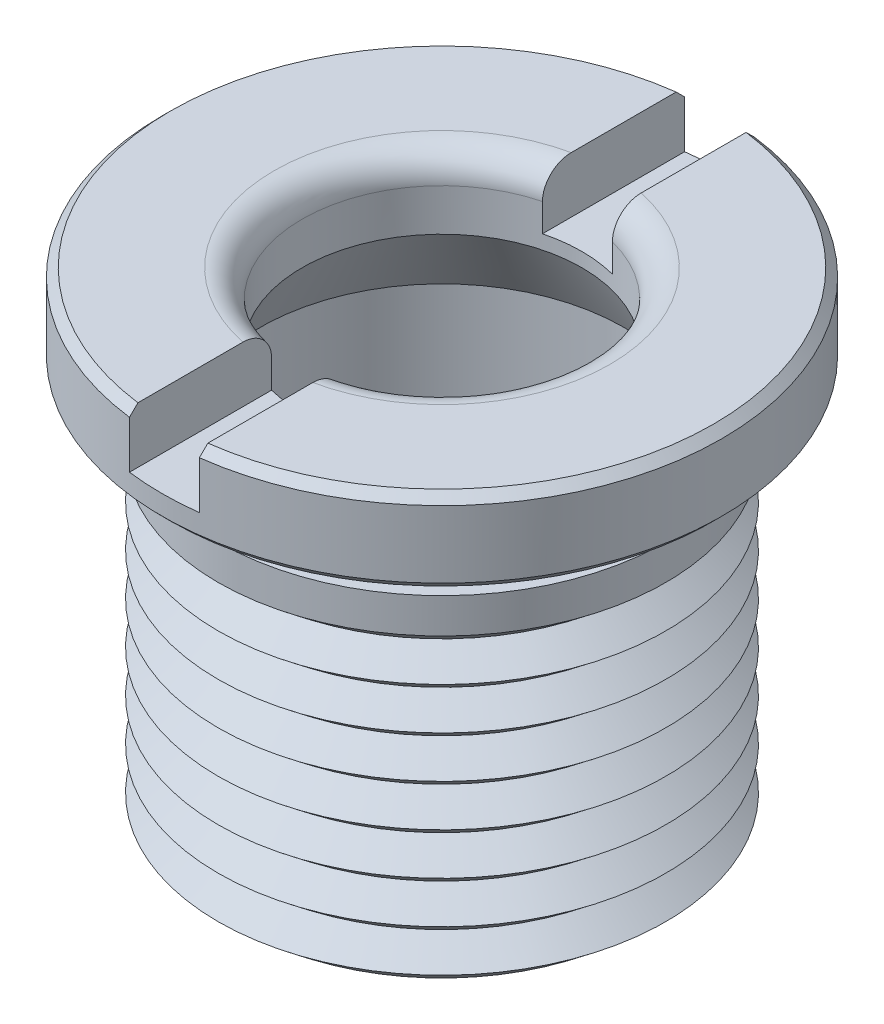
from build123d import *

# Parameters (mm, degrees)
SKETCH3_W       = 2.5
SKETCH3_H       = 20
EXTRUDE1_DEPTH  = 2
LPATTERN1_COUNT = 8
LPATTERN1_PITCH = 1.5


with BuildPart() as part:
    # Sketch1 → Revolve1 (revolve)
    with BuildSketch(Plane.XY, mode=Mode.PRIVATE) as revolve1_sk:
        with BuildLine():
            Line((6.5, 0), (8, 0))
            Line((8, 0), (8, 12.5))
            Line((8, 12.5), (7.5, 12.5))
            ThreePointArc((7.5, 12.5), (7.146446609, 12.646446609), (7, 13))
            Line((7, 13), (7, 13.5))
            ThreePointArc((7, 13.5), (7.146446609, 13.853553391), (7.5, 14))
            Line((7.5, 14), (9.7, 14))
            Line((9.7, 14), (10, 14.3))
            Line((10, 14.3), (10, 16.7))
            Line((10, 16.7), (9.7, 17))
            Line((9.7, 17), (6, 17))
            ThreePointArc((6, 17), (5.292893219, 16.707106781), (5, 16))
            Line((5, 16), (5, 14.498076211))
            Line((5, 14.498076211), (6.5, 11.9))
            Line((6.5, 11.9), (6.5, 0))
        make_face()
    revolve(revolve1_sk.sketch.rotate(Axis((0, 0, 0), (0, 1, 0)), 90), axis=Axis((0, 0, 0), (0, 1, 0)))

    # Sketch3 → Extrude1 (cut)
    with BuildSketch(Plane(origin=(0, 17, 0), x_dir=(1, 0, 0), z_dir=(0, 1, 0))):
        Rectangle(SKETCH3_W, SKETCH3_H)
    extrude(amount=-EXTRUDE1_DEPTH, mode=Mode.SUBTRACT)

    # Sketch2 → Cut-Revolve1 (revolve, cut)
    with BuildSketch(Plane.XY, mode=Mode.PRIVATE) as cut_revolve1_sk:
        Polygon((8, 0.75), (8, -0.75), (7.0632503, 0), align=None)
    cut_revolve1 = revolve(cut_revolve1_sk.sketch.rotate(Axis((0, 0, 0), (0, 1, 0)), 90), axis=Axis((0, 0, 0), (0, 1, 0)), mode=Mode.SUBTRACT)

    # LPattern1: Cut-Revolve1 ×8
    with Locations(*[(0, i * LPATTERN1_PITCH, 0) for i in range(1, LPATTERN1_COUNT)]):
        add(cut_revolve1, mode=Mode.SUBTRACT)


solid = part.part
